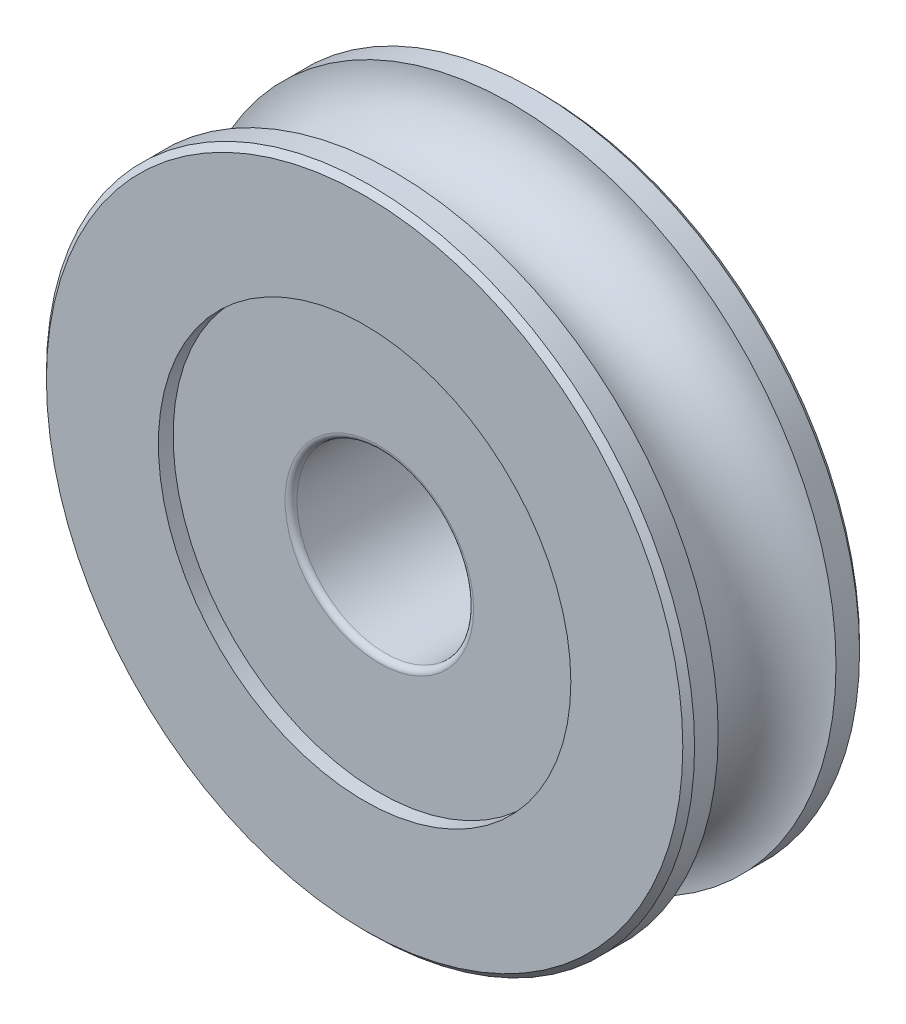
ISO-10303-21;
HEADER;
FILE_DESCRIPTION(('STEP AP214'),'2;1');
FILE_NAME('part.step','',(''),(''),'','','');
FILE_SCHEMA(('AUTOMOTIVE_DESIGN { 1 0 10303 214 1 1 1 1 }'));
ENDSEC;
DATA;
#1=APPLICATION_CONTEXT('core data for automotive mechanical design processes');
#2=APPLICATION_PROTOCOL_DEFINITION('international standard','automotive_design',2000,#1);
#3=PRODUCT_CONTEXT('',#1,'mechanical');
#4=PRODUCT('Part','Part','',(#3));
#5=PRODUCT_RELATED_PRODUCT_CATEGORY('part','',(#4));
#6=PRODUCT_DEFINITION_FORMATION('','',#4);
#7=PRODUCT_DEFINITION_CONTEXT('part definition',#1,'design');
#8=PRODUCT_DEFINITION('design','',#6,#7);
#9=PRODUCT_DEFINITION_SHAPE('','',#8);
#10=(LENGTH_UNIT() NAMED_UNIT(*) SI_UNIT(.MILLI.,.METRE.));
#11=(NAMED_UNIT(*) PLANE_ANGLE_UNIT() SI_UNIT($,.RADIAN.));
#12=(NAMED_UNIT(*) SI_UNIT($,.STERADIAN.) SOLID_ANGLE_UNIT());
#13=UNCERTAINTY_MEASURE_WITH_UNIT(LENGTH_MEASURE(1.E-05),#10,'distance_accuracy_value','');
#14=(GEOMETRIC_REPRESENTATION_CONTEXT(3) GLOBAL_UNCERTAINTY_ASSIGNED_CONTEXT((#13)) GLOBAL_UNIT_ASSIGNED_CONTEXT((#10,
#11,#12)) REPRESENTATION_CONTEXT('',''));
#15=CARTESIAN_POINT('',(0.,0.,0.));
#16=DIRECTION('',(0.,0.,1.));
#17=DIRECTION('',(1.,0.,0.));
#18=AXIS2_PLACEMENT_3D('',#15,#16,#17);
#19=CARTESIAN_POINT('',(0.,0.,2.3));
#20=DIRECTION('',(0.,0.,1.));
#21=DIRECTION('',(1.,0.,0.));
#22=AXIS2_PLACEMENT_3D('',#19,#20,#21);
#23=TOROIDAL_SURFACE('',#22,3.2,0.200000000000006);
#24=CARTESIAN_POINT('',(0.,0.,2.3));
#25=DIRECTION('',(0.,0.,1.));
#26=DIRECTION('',(1.,0.,0.));
#27=AXIS2_PLACEMENT_3D('',#24,#25,#26);
#28=CIRCLE('',#27,3.);
#29=CARTESIAN_POINT('',(3.,0.,2.3));
#30=VERTEX_POINT('',#29);
#31=EDGE_CURVE('E8',#30,#30,#28,.T.);
#32=ORIENTED_EDGE('',*,*,#31,.F.);
#33=EDGE_LOOP('',(#32));
#34=FACE_BOUND('',#33,.T.);
#35=CARTESIAN_POINT('',(0.,0.,2.5));
#36=DIRECTION('',(0.,0.,1.));
#37=DIRECTION('',(1.,0.,0.));
#38=AXIS2_PLACEMENT_3D('',#35,#36,#37);
#39=CIRCLE('',#38,3.2);
#40=CARTESIAN_POINT('',(3.2,0.,2.5));
#41=VERTEX_POINT('',#40);
#42=EDGE_CURVE('E58',#41,#41,#39,.T.);
#43=ORIENTED_EDGE('',*,*,#42,.T.);
#44=EDGE_LOOP('',(#43));
#45=FACE_BOUND('',#44,.T.);
#46=ADVANCED_FACE('F12',(#34,#45),#23,.T.);
#47=CARTESIAN_POINT('',(0.,0.,6.));
#48=DIRECTION('',(0.,0.,1.));
#49=DIRECTION('',(1.,0.,0.));
#50=AXIS2_PLACEMENT_3D('',#47,#48,#49);
#51=CYLINDRICAL_SURFACE('',#50,3.);
#52=CARTESIAN_POINT('',(0.,0.,-2.3));
#53=DIRECTION('',(0.,0.,1.));
#54=DIRECTION('',(1.,0.,0.));
#55=AXIS2_PLACEMENT_3D('',#52,#53,#54);
#56=CIRCLE('',#55,3.);
#57=CARTESIAN_POINT('',(3.,0.,-2.3));
#58=VERTEX_POINT('',#57);
#59=EDGE_CURVE('E18',#58,#58,#56,.T.);
#60=ORIENTED_EDGE('',*,*,#59,.F.);
#61=EDGE_LOOP('',(#60));
#62=FACE_BOUND('',#61,.T.);
#63=ORIENTED_EDGE('',*,*,#31,.T.);
#64=EDGE_LOOP('',(#63));
#65=FACE_BOUND('',#64,.T.);
#66=ADVANCED_FACE('F131',(#62,#65),#51,.F.);
#67=CARTESIAN_POINT('',(0.,0.,-2.3));
#68=DIRECTION('',(0.,0.,1.));
#69=DIRECTION('',(1.,0.,0.));
#70=AXIS2_PLACEMENT_3D('',#67,#68,#69);
#71=TOROIDAL_SURFACE('',#70,3.2,0.200000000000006);
#72=CARTESIAN_POINT('',(0.,0.,-2.5));
#73=DIRECTION('',(0.,0.,1.));
#74=DIRECTION('',(1.,0.,0.));
#75=AXIS2_PLACEMENT_3D('',#72,#73,#74);
#76=CIRCLE('',#75,3.2);
#77=CARTESIAN_POINT('',(3.2,0.,-2.5));
#78=VERTEX_POINT('',#77);
#79=EDGE_CURVE('E22',#78,#78,#76,.T.);
#80=ORIENTED_EDGE('',*,*,#79,.F.);
#81=EDGE_LOOP('',(#80));
#82=FACE_BOUND('',#81,.T.);
#83=ORIENTED_EDGE('',*,*,#59,.T.);
#84=EDGE_LOOP('',(#83));
#85=FACE_BOUND('',#84,.T.);
#86=ADVANCED_FACE('F126',(#82,#85),#71,.T.);
#87=CARTESIAN_POINT('',(0.,3.2,-2.5));
#88=DIRECTION('',(0.,0.,1.));
#89=DIRECTION('',(1.,0.,0.));
#90=AXIS2_PLACEMENT_3D('',#87,#88,#89);
#91=PLANE('',#90);
#92=CARTESIAN_POINT('',(0.,0.,-2.5));
#93=DIRECTION('',(0.,0.,1.));
#94=DIRECTION('',(1.,0.,0.));
#95=AXIS2_PLACEMENT_3D('',#92,#93,#94);
#96=CIRCLE('',#95,7.);
#97=CARTESIAN_POINT('',(7.,0.,-2.5));
#98=VERTEX_POINT('',#97);
#99=EDGE_CURVE('E26',#98,#98,#96,.T.);
#100=ORIENTED_EDGE('',*,*,#99,.F.);
#101=EDGE_LOOP('',(#100));
#102=FACE_BOUND('',#101,.T.);
#103=ORIENTED_EDGE('',*,*,#79,.T.);
#104=EDGE_LOOP('',(#103));
#105=FACE_BOUND('',#104,.T.);
#106=ADVANCED_FACE('F120',(#102,#105),#91,.F.);
#107=CARTESIAN_POINT('',(0.,0.,6.));
#108=DIRECTION('',(0.,0.,1.));
#109=DIRECTION('',(1.,0.,0.));
#110=AXIS2_PLACEMENT_3D('',#107,#108,#109);
#111=CYLINDRICAL_SURFACE('',#110,7.);
#112=CARTESIAN_POINT('',(0.,0.,-3.));
#113=DIRECTION('',(0.,0.,1.));
#114=DIRECTION('',(1.,0.,0.));
#115=AXIS2_PLACEMENT_3D('',#112,#113,#114);
#116=CIRCLE('',#115,7.);
#117=CARTESIAN_POINT('',(7.,0.,-3.));
#118=VERTEX_POINT('',#117);
#119=EDGE_CURVE('E31',#118,#118,#116,.T.);
#120=ORIENTED_EDGE('',*,*,#119,.F.);
#121=EDGE_LOOP('',(#120));
#122=FACE_BOUND('',#121,.T.);
#123=ORIENTED_EDGE('',*,*,#99,.T.);
#124=EDGE_LOOP('',(#123));
#125=FACE_BOUND('',#124,.T.);
#126=ADVANCED_FACE('F114',(#122,#125),#111,.F.);
#127=CARTESIAN_POINT('',(0.,10.8,-3.));
#128=DIRECTION('',(0.,0.,1.));
#129=DIRECTION('',(1.,0.,0.));
#130=AXIS2_PLACEMENT_3D('',#127,#128,#129);
#131=PLANE('',#130);
#132=CARTESIAN_POINT('',(0.,0.,-3.));
#133=DIRECTION('',(0.,0.,1.));
#134=DIRECTION('',(1.,0.,0.));
#135=AXIS2_PLACEMENT_3D('',#132,#133,#134);
#136=CIRCLE('',#135,10.8);
#137=CARTESIAN_POINT('',(10.8,0.,-3.));
#138=VERTEX_POINT('',#137);
#139=EDGE_CURVE('E34',#138,#138,#136,.T.);
#140=ORIENTED_EDGE('',*,*,#139,.F.);
#141=EDGE_LOOP('',(#140));
#142=FACE_BOUND('',#141,.T.);
#143=ORIENTED_EDGE('',*,*,#119,.T.);
#144=EDGE_LOOP('',(#143));
#145=FACE_BOUND('',#144,.T.);
#146=ADVANCED_FACE('F108',(#142,#145),#131,.F.);
#147=CARTESIAN_POINT('',(0.,0.,-3.));
#148=DIRECTION('',(0.,0.,1.));
#149=DIRECTION('',(1.,0.,0.));
#150=AXIS2_PLACEMENT_3D('',#147,#148,#149);
#151=CONICAL_SURFACE('',#150,10.8,0.785398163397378);
#152=CARTESIAN_POINT('',(0.,0.,-2.8));
#153=DIRECTION('',(0.,0.,1.));
#154=DIRECTION('',(1.,0.,0.));
#155=AXIS2_PLACEMENT_3D('',#152,#153,#154);
#156=CIRCLE('',#155,11.);
#157=CARTESIAN_POINT('',(11.,0.,-2.8));
#158=VERTEX_POINT('',#157);
#159=EDGE_CURVE('E37',#158,#158,#156,.T.);
#160=ORIENTED_EDGE('',*,*,#159,.F.);
#161=EDGE_LOOP('',(#160));
#162=FACE_BOUND('',#161,.T.);
#163=ORIENTED_EDGE('',*,*,#139,.T.);
#164=EDGE_LOOP('',(#163));
#165=FACE_BOUND('',#164,.T.);
#166=ADVANCED_FACE('F102',(#162,#165),#151,.T.);
#167=CARTESIAN_POINT('',(0.,0.,6.));
#168=DIRECTION('',(0.,0.,1.));
#169=DIRECTION('',(1.,0.,0.));
#170=AXIS2_PLACEMENT_3D('',#167,#168,#169);
#171=CYLINDRICAL_SURFACE('',#170,11.);
#172=CARTESIAN_POINT('',(0.,0.,-2.));
#173=DIRECTION('',(0.,0.,1.));
#174=DIRECTION('',(1.,0.,0.));
#175=AXIS2_PLACEMENT_3D('',#172,#173,#174);
#176=CIRCLE('',#175,11.);
#177=CARTESIAN_POINT('',(11.,0.,-2.));
#178=VERTEX_POINT('',#177);
#179=EDGE_CURVE('E40',#178,#178,#176,.T.);
#180=ORIENTED_EDGE('',*,*,#179,.F.);
#181=EDGE_LOOP('',(#180));
#182=FACE_BOUND('',#181,.T.);
#183=ORIENTED_EDGE('',*,*,#159,.T.);
#184=EDGE_LOOP('',(#183));
#185=FACE_BOUND('',#184,.T.);
#186=ADVANCED_FACE('F96',(#182,#185),#171,.T.);
#187=CARTESIAN_POINT('',(0.,0.,0.));
#188=DIRECTION('',(0.,0.,1.));
#189=DIRECTION('',(1.,0.,0.));
#190=AXIS2_PLACEMENT_3D('',#187,#188,#189);
#191=TOROIDAL_SURFACE('',#190,11.,2.);
#192=CARTESIAN_POINT('',(0.,0.,2.));
#193=DIRECTION('',(0.,0.,1.));
#194=DIRECTION('',(1.,0.,0.));
#195=AXIS2_PLACEMENT_3D('',#192,#193,#194);
#196=CIRCLE('',#195,11.);
#197=CARTESIAN_POINT('',(11.,0.,2.));
#198=VERTEX_POINT('',#197);
#199=EDGE_CURVE('E43',#198,#198,#196,.T.);
#200=ORIENTED_EDGE('',*,*,#199,.F.);
#201=EDGE_LOOP('',(#200));
#202=FACE_BOUND('',#201,.T.);
#203=ORIENTED_EDGE('',*,*,#179,.T.);
#204=EDGE_LOOP('',(#203));
#205=FACE_BOUND('',#204,.T.);
#206=ADVANCED_FACE('F90',(#202,#205),#191,.F.);
#207=CARTESIAN_POINT('',(0.,0.,6.));
#208=DIRECTION('',(0.,0.,1.));
#209=DIRECTION('',(1.,0.,0.));
#210=AXIS2_PLACEMENT_3D('',#207,#208,#209);
#211=CYLINDRICAL_SURFACE('',#210,11.);
#212=CARTESIAN_POINT('',(0.,0.,2.8));
#213=DIRECTION('',(0.,0.,1.));
#214=DIRECTION('',(1.,0.,0.));
#215=AXIS2_PLACEMENT_3D('',#212,#213,#214);
#216=CIRCLE('',#215,11.);
#217=CARTESIAN_POINT('',(11.,0.,2.8));
#218=VERTEX_POINT('',#217);
#219=EDGE_CURVE('E46',#218,#218,#216,.T.);
#220=ORIENTED_EDGE('',*,*,#219,.F.);
#221=EDGE_LOOP('',(#220));
#222=FACE_BOUND('',#221,.T.);
#223=ORIENTED_EDGE('',*,*,#199,.T.);
#224=EDGE_LOOP('',(#223));
#225=FACE_BOUND('',#224,.T.);
#226=ADVANCED_FACE('F84',(#222,#225),#211,.T.);
#227=CARTESIAN_POINT('',(0.,0.,2.8));
#228=DIRECTION('',(0.,0.,-1.));
#229=DIRECTION('',(-1.,0.,0.));
#230=AXIS2_PLACEMENT_3D('',#227,#228,#229);
#231=CONICAL_SURFACE('',#230,11.,0.785398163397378);
#232=CARTESIAN_POINT('',(0.,0.,3.));
#233=DIRECTION('',(0.,0.,1.));
#234=DIRECTION('',(1.,0.,0.));
#235=AXIS2_PLACEMENT_3D('',#232,#233,#234);
#236=CIRCLE('',#235,10.8);
#237=CARTESIAN_POINT('',(10.8,0.,3.));
#238=VERTEX_POINT('',#237);
#239=EDGE_CURVE('E49',#238,#238,#236,.T.);
#240=ORIENTED_EDGE('',*,*,#239,.F.);
#241=EDGE_LOOP('',(#240));
#242=FACE_BOUND('',#241,.T.);
#243=ORIENTED_EDGE('',*,*,#219,.T.);
#244=EDGE_LOOP('',(#243));
#245=FACE_BOUND('',#244,.T.);
#246=ADVANCED_FACE('F78',(#242,#245),#231,.T.);
#247=CARTESIAN_POINT('',(0.,7.,3.));
#248=DIRECTION('',(0.,0.,-1.));
#249=DIRECTION('',(-1.,0.,0.));
#250=AXIS2_PLACEMENT_3D('',#247,#248,#249);
#251=PLANE('',#250);
#252=CARTESIAN_POINT('',(0.,0.,3.));
#253=DIRECTION('',(0.,0.,1.));
#254=DIRECTION('',(1.,0.,0.));
#255=AXIS2_PLACEMENT_3D('',#252,#253,#254);
#256=CIRCLE('',#255,7.);
#257=CARTESIAN_POINT('',(7.,0.,3.));
#258=VERTEX_POINT('',#257);
#259=EDGE_CURVE('E52',#258,#258,#256,.T.);
#260=ORIENTED_EDGE('',*,*,#259,.F.);
#261=EDGE_LOOP('',(#260));
#262=FACE_BOUND('',#261,.T.);
#263=ORIENTED_EDGE('',*,*,#239,.T.);
#264=EDGE_LOOP('',(#263));
#265=FACE_BOUND('',#264,.T.);
#266=ADVANCED_FACE('F72',(#262,#265),#251,.F.);
#267=CARTESIAN_POINT('',(0.,0.,6.));
#268=DIRECTION('',(0.,0.,1.));
#269=DIRECTION('',(1.,0.,0.));
#270=AXIS2_PLACEMENT_3D('',#267,#268,#269);
#271=CYLINDRICAL_SURFACE('',#270,7.);
#272=CARTESIAN_POINT('',(0.,0.,2.5));
#273=DIRECTION('',(0.,0.,1.));
#274=DIRECTION('',(1.,0.,0.));
#275=AXIS2_PLACEMENT_3D('',#272,#273,#274);
#276=CIRCLE('',#275,7.);
#277=CARTESIAN_POINT('',(7.,0.,2.5));
#278=VERTEX_POINT('',#277);
#279=EDGE_CURVE('E55',#278,#278,#276,.T.);
#280=ORIENTED_EDGE('',*,*,#279,.F.);
#281=EDGE_LOOP('',(#280));
#282=FACE_BOUND('',#281,.T.);
#283=ORIENTED_EDGE('',*,*,#259,.T.);
#284=EDGE_LOOP('',(#283));
#285=FACE_BOUND('',#284,.T.);
#286=ADVANCED_FACE('F66',(#282,#285),#271,.F.);
#287=CARTESIAN_POINT('',(0.,3.2,2.5));
#288=DIRECTION('',(0.,0.,-1.));
#289=DIRECTION('',(-1.,0.,0.));
#290=AXIS2_PLACEMENT_3D('',#287,#288,#289);
#291=PLANE('',#290);
#292=ORIENTED_EDGE('',*,*,#42,.F.);
#293=EDGE_LOOP('',(#292));
#294=FACE_BOUND('',#293,.T.);
#295=ORIENTED_EDGE('',*,*,#279,.T.);
#296=EDGE_LOOP('',(#295));
#297=FACE_BOUND('',#296,.T.);
#298=ADVANCED_FACE('F63',(#294,#297),#291,.F.);
#299=CLOSED_SHELL('',(#46,#66,#86,#106,#126,#146,#166,#186,#206,#226,#246,#266,#286,#298));
#300=MANIFOLD_SOLID_BREP('B1',#299);
#301=ADVANCED_BREP_SHAPE_REPRESENTATION('',(#18,#300),#14);
#302=SHAPE_DEFINITION_REPRESENTATION(#9,#301);
ENDSEC;
END-ISO-10303-21;
